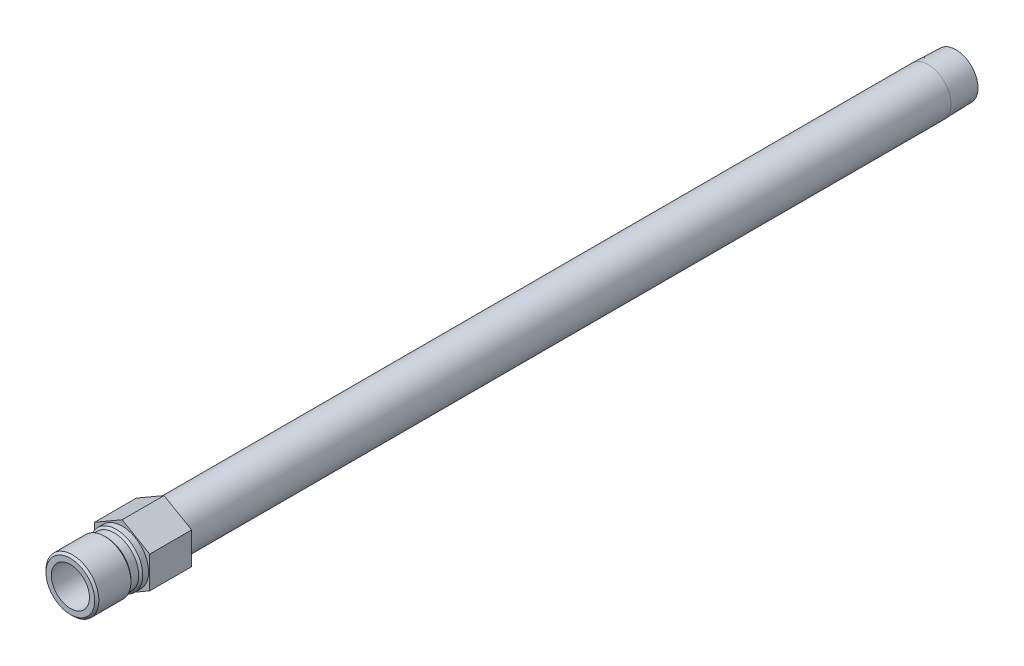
ISO-10303-21;
HEADER;
FILE_DESCRIPTION(('STEP AP214'),'2;1');
FILE_NAME('part.step','',(''),(''),'','','');
FILE_SCHEMA(('AUTOMOTIVE_DESIGN { 1 0 10303 214 1 1 1 1 }'));
ENDSEC;
DATA;
#1=APPLICATION_CONTEXT('core data for automotive mechanical design processes');
#2=APPLICATION_PROTOCOL_DEFINITION('international standard','automotive_design',2000,#1);
#3=PRODUCT_CONTEXT('',#1,'mechanical');
#4=PRODUCT('Part','Part','',(#3));
#5=PRODUCT_RELATED_PRODUCT_CATEGORY('part','',(#4));
#6=PRODUCT_DEFINITION_FORMATION('','',#4);
#7=PRODUCT_DEFINITION_CONTEXT('part definition',#1,'design');
#8=PRODUCT_DEFINITION('design','',#6,#7);
#9=PRODUCT_DEFINITION_SHAPE('','',#8);
#10=(LENGTH_UNIT() NAMED_UNIT(*) SI_UNIT(.MILLI.,.METRE.));
#11=(NAMED_UNIT(*) PLANE_ANGLE_UNIT() SI_UNIT($,.RADIAN.));
#12=(NAMED_UNIT(*) SI_UNIT($,.STERADIAN.) SOLID_ANGLE_UNIT());
#13=UNCERTAINTY_MEASURE_WITH_UNIT(LENGTH_MEASURE(1.E-05),#10,'distance_accuracy_value','');
#14=(GEOMETRIC_REPRESENTATION_CONTEXT(3) GLOBAL_UNCERTAINTY_ASSIGNED_CONTEXT((#13)) GLOBAL_UNIT_ASSIGNED_CONTEXT((#10,
#11,#12)) REPRESENTATION_CONTEXT('',''));
#15=CARTESIAN_POINT('',(0.,0.,0.));
#16=DIRECTION('',(0.,0.,1.));
#17=DIRECTION('',(1.,0.,0.));
#18=AXIS2_PLACEMENT_3D('',#15,#16,#17);
#19=CARTESIAN_POINT('',(0.,0.,0.));
#20=DIRECTION('',(0.,0.,-1.));
#21=DIRECTION('',(0.,1.,0.));
#22=AXIS2_PLACEMENT_3D('',#19,#20,#21);
#23=CYLINDRICAL_SURFACE('',#22,8.5725);
#24=CARTESIAN_POINT('',(0.,0.,-300.5582));
#25=DIRECTION('',(0.,0.,-1.));
#26=DIRECTION('',(0.,1.,0.));
#27=AXIS2_PLACEMENT_3D('',#24,#25,#26);
#28=CIRCLE('',#27,8.57250000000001);
#29=CARTESIAN_POINT('',(0.,8.5725,-300.5582));
#30=VERTEX_POINT('',#29);
#31=EDGE_CURVE('E158',#30,#30,#28,.T.);
#32=ORIENTED_EDGE('',*,*,#31,.F.);
#33=EDGE_LOOP('',(#32));
#34=FACE_BOUND('',#33,.T.);
#35=CARTESIAN_POINT('',(0.,0.,-15.621));
#36=DIRECTION('',(0.,0.,1.));
#37=DIRECTION('',(1.,0.,0.));
#38=AXIS2_PLACEMENT_3D('',#35,#36,#37);
#39=CIRCLE('',#38,8.5725);
#40=CARTESIAN_POINT('',(8.5725,0.,-15.621));
#41=VERTEX_POINT('',#40);
#42=EDGE_CURVE('E39',#41,#41,#39,.F.);
#43=ORIENTED_EDGE('',*,*,#42,.T.);
#44=EDGE_LOOP('',(#43));
#45=FACE_BOUND('',#44,.T.);
#46=ADVANCED_FACE('F35',(#34,#45),#23,.T.);
#47=CARTESIAN_POINT('',(0.,0.,0.));
#48=DIRECTION('',(0.,0.,-1.));
#49=DIRECTION('',(0.,1.,0.));
#50=AXIS2_PLACEMENT_3D('',#47,#48,#49);
#51=CYLINDRICAL_SURFACE('',#50,7.112);
#52=CARTESIAN_POINT('',(0.,0.,1.524));
#53=DIRECTION('',(0.,0.,-1.));
#54=DIRECTION('',(0.,1.,0.));
#55=AXIS2_PLACEMENT_3D('',#52,#53,#54);
#56=CIRCLE('',#55,7.112);
#57=CARTESIAN_POINT('',(0.,7.112,1.524));
#58=VERTEX_POINT('',#57);
#59=EDGE_CURVE('E146',#58,#58,#56,.T.);
#60=ORIENTED_EDGE('',*,*,#59,.T.);
#61=EDGE_LOOP('',(#60));
#62=FACE_BOUND('',#61,.T.);
#63=CARTESIAN_POINT('',(0.,0.,19.304));
#64=DIRECTION('',(0.,0.,-1.));
#65=DIRECTION('',(0.,1.,0.));
#66=AXIS2_PLACEMENT_3D('',#63,#64,#65);
#67=CIRCLE('',#66,7.112);
#68=CARTESIAN_POINT('',(0.,7.112,19.304));
#69=VERTEX_POINT('',#68);
#70=EDGE_CURVE('E11',#69,#69,#67,.T.);
#71=ORIENTED_EDGE('',*,*,#70,.F.);
#72=EDGE_LOOP('',(#71));
#73=FACE_BOUND('',#72,.T.);
#74=ADVANCED_FACE('F37',(#62,#73),#51,.F.);
#75=CARTESIAN_POINT('',(0.,7.112,19.304));
#76=DIRECTION('',(0.,0.,1.));
#77=DIRECTION('',(0.,-1.,0.));
#78=AXIS2_PLACEMENT_3D('',#75,#76,#77);
#79=PLANE('',#78);
#80=ORIENTED_EDGE('',*,*,#70,.T.);
#81=EDGE_LOOP('',(#80));
#82=FACE_BOUND('',#81,.T.);
#83=CARTESIAN_POINT('',(0.,0.,19.304));
#84=DIRECTION('',(0.,0.,-1.));
#85=DIRECTION('',(0.,1.,0.));
#86=AXIS2_PLACEMENT_3D('',#83,#84,#85);
#87=CIRCLE('',#86,9.09319999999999);
#88=CARTESIAN_POINT('',(0.,9.0932,19.304));
#89=VERTEX_POINT('',#88);
#90=EDGE_CURVE('E45',#89,#89,#87,.T.);
#91=ORIENTED_EDGE('',*,*,#90,.F.);
#92=EDGE_LOOP('',(#91));
#93=FACE_BOUND('',#92,.T.);
#94=ADVANCED_FACE('F185',(#82,#93),#79,.T.);
#95=CARTESIAN_POINT('',(0.,0.,18.542));
#96=DIRECTION('',(0.,0.,-1.));
#97=DIRECTION('',(0.,1.,0.));
#98=AXIS2_PLACEMENT_3D('',#95,#96,#97);
#99=CONICAL_SURFACE('',#98,9.8552,0.785398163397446);
#100=ORIENTED_EDGE('',*,*,#90,.T.);
#101=EDGE_LOOP('',(#100));
#102=FACE_BOUND('',#101,.T.);
#103=CARTESIAN_POINT('',(0.,0.,18.542));
#104=DIRECTION('',(0.,0.,-1.));
#105=DIRECTION('',(0.,1.,0.));
#106=AXIS2_PLACEMENT_3D('',#103,#104,#105);
#107=CIRCLE('',#106,9.8552);
#108=CARTESIAN_POINT('',(0.,9.8552,18.542));
#109=VERTEX_POINT('',#108);
#110=EDGE_CURVE('E176',#109,#109,#107,.T.);
#111=ORIENTED_EDGE('',*,*,#110,.F.);
#112=EDGE_LOOP('',(#111));
#113=FACE_BOUND('',#112,.T.);
#114=ADVANCED_FACE('F182',(#102,#113),#99,.T.);
#115=CARTESIAN_POINT('',(0.,0.,0.));
#116=DIRECTION('',(0.,0.,-1.));
#117=DIRECTION('',(0.,1.,0.));
#118=AXIS2_PLACEMENT_3D('',#115,#116,#117);
#119=CYLINDRICAL_SURFACE('',#118,9.8552);
#120=ORIENTED_EDGE('',*,*,#110,.T.);
#121=EDGE_LOOP('',(#120));
#122=FACE_BOUND('',#121,.T.);
#123=CARTESIAN_POINT('',(0.,0.,6.5786));
#124=DIRECTION('',(0.,0.,-1.));
#125=DIRECTION('',(0.,1.,0.));
#126=AXIS2_PLACEMENT_3D('',#123,#124,#125);
#127=CIRCLE('',#126,9.8552);
#128=CARTESIAN_POINT('',(0.,9.8552,6.5786));
#129=VERTEX_POINT('',#128);
#130=EDGE_CURVE('E173',#129,#129,#127,.T.);
#131=ORIENTED_EDGE('',*,*,#130,.F.);
#132=EDGE_LOOP('',(#131));
#133=FACE_BOUND('',#132,.T.);
#134=ADVANCED_FACE('F192',(#122,#133),#119,.T.);
#135=CARTESIAN_POINT('',(0.,0.,5.8166));
#136=DIRECTION('',(0.,0.,1.));
#137=DIRECTION('',(0.,-1.,0.));
#138=AXIS2_PLACEMENT_3D('',#135,#136,#137);
#139=CONICAL_SURFACE('',#138,9.0932,0.785398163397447);
#140=ORIENTED_EDGE('',*,*,#130,.T.);
#141=EDGE_LOOP('',(#140));
#142=FACE_BOUND('',#141,.T.);
#143=CARTESIAN_POINT('',(0.,0.,5.8166));
#144=DIRECTION('',(0.,0.,-1.));
#145=DIRECTION('',(0.,1.,0.));
#146=AXIS2_PLACEMENT_3D('',#143,#144,#145);
#147=CIRCLE('',#146,9.0932);
#148=CARTESIAN_POINT('',(0.,9.0932,5.8166));
#149=VERTEX_POINT('',#148);
#150=EDGE_CURVE('E170',#149,#149,#147,.T.);
#151=ORIENTED_EDGE('',*,*,#150,.F.);
#152=EDGE_LOOP('',(#151));
#153=FACE_BOUND('',#152,.T.);
#154=ADVANCED_FACE('F217',(#142,#153),#139,.T.);
#155=CARTESIAN_POINT('',(0.,0.,0.));
#156=DIRECTION('',(0.,0.,-1.));
#157=DIRECTION('',(0.,1.,0.));
#158=AXIS2_PLACEMENT_3D('',#155,#156,#157);
#159=CYLINDRICAL_SURFACE('',#158,9.0932);
#160=ORIENTED_EDGE('',*,*,#150,.T.);
#161=EDGE_LOOP('',(#160));
#162=FACE_BOUND('',#161,.T.);
#163=CARTESIAN_POINT('',(0.,0.,2.921));
#164=DIRECTION('',(0.,0.,-1.));
#165=DIRECTION('',(0.,1.,0.));
#166=AXIS2_PLACEMENT_3D('',#163,#164,#165);
#167=CIRCLE('',#166,9.0932);
#168=CARTESIAN_POINT('',(0.,9.0932,2.921));
#169=VERTEX_POINT('',#168);
#170=EDGE_CURVE('E167',#169,#169,#167,.T.);
#171=ORIENTED_EDGE('',*,*,#170,.F.);
#172=EDGE_LOOP('',(#171));
#173=FACE_BOUND('',#172,.T.);
#174=ADVANCED_FACE('F213',(#162,#173),#159,.T.);
#175=CARTESIAN_POINT('',(0.,0.,2.159));
#176=DIRECTION('',(0.,0.,-1.));
#177=DIRECTION('',(0.,1.,0.));
#178=AXIS2_PLACEMENT_3D('',#175,#176,#177);
#179=CONICAL_SURFACE('',#178,9.8552,0.785398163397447);
#180=ORIENTED_EDGE('',*,*,#170,.T.);
#181=EDGE_LOOP('',(#180));
#182=FACE_BOUND('',#181,.T.);
#183=CARTESIAN_POINT('',(0.,0.,2.159));
#184=DIRECTION('',(0.,0.,-1.));
#185=DIRECTION('',(0.,1.,0.));
#186=AXIS2_PLACEMENT_3D('',#183,#184,#185);
#187=CIRCLE('',#186,9.8552);
#188=CARTESIAN_POINT('',(0.,9.8552,2.159));
#189=VERTEX_POINT('',#188);
#190=EDGE_CURVE('E164',#189,#189,#187,.T.);
#191=ORIENTED_EDGE('',*,*,#190,.F.);
#192=EDGE_LOOP('',(#191));
#193=FACE_BOUND('',#192,.T.);
#194=ADVANCED_FACE('F209',(#182,#193),#179,.T.);
#195=CARTESIAN_POINT('',(0.,0.,0.));
#196=DIRECTION('',(0.,0.,-1.));
#197=DIRECTION('',(0.,1.,0.));
#198=AXIS2_PLACEMENT_3D('',#195,#196,#197);
#199=CYLINDRICAL_SURFACE('',#198,9.8552);
#200=ORIENTED_EDGE('',*,*,#190,.T.);
#201=EDGE_LOOP('',(#200));
#202=FACE_BOUND('',#201,.T.);
#203=CARTESIAN_POINT('',(0.,0.,0.));
#204=DIRECTION('',(0.,0.,-1.));
#205=DIRECTION('',(0.,1.,0.));
#206=AXIS2_PLACEMENT_3D('',#203,#204,#205);
#207=CIRCLE('',#206,9.8552);
#208=CARTESIAN_POINT('',(0.,9.8552,0.));
#209=VERTEX_POINT('',#208);
#210=EDGE_CURVE('E161',#209,#209,#207,.T.);
#211=ORIENTED_EDGE('',*,*,#210,.F.);
#212=EDGE_LOOP('',(#211));
#213=FACE_BOUND('',#212,.T.);
#214=ADVANCED_FACE('F206',(#202,#213),#199,.T.);
#215=CARTESIAN_POINT('',(0.,0.,-310.896));
#216=DIRECTION('',(0.,0.,1.));
#217=DIRECTION('',(0.,-1.,0.));
#218=AXIS2_PLACEMENT_3D('',#215,#216,#217);
#219=CONICAL_SURFACE('',#218,8.24944566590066,0.0312396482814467);
#220=ORIENTED_EDGE('',*,*,#31,.T.);
#221=EDGE_LOOP('',(#220));
#222=FACE_BOUND('',#221,.T.);
#223=CARTESIAN_POINT('',(0.,0.,-310.896));
#224=DIRECTION('',(0.,0.,-1.));
#225=DIRECTION('',(0.,1.,0.));
#226=AXIS2_PLACEMENT_3D('',#223,#224,#225);
#227=CIRCLE('',#226,8.24944566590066);
#228=CARTESIAN_POINT('',(0.,8.24944566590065,-310.896));
#229=VERTEX_POINT('',#228);
#230=EDGE_CURVE('E155',#229,#229,#227,.T.);
#231=ORIENTED_EDGE('',*,*,#230,.F.);
#232=EDGE_LOOP('',(#231));
#233=FACE_BOUND('',#232,.T.);
#234=ADVANCED_FACE('F204',(#222,#233),#219,.T.);
#235=CARTESIAN_POINT('',(0.,8.24944566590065,-310.896));
#236=DIRECTION('',(0.,0.,-1.));
#237=DIRECTION('',(0.,1.,0.));
#238=AXIS2_PLACEMENT_3D('',#235,#236,#237);
#239=PLANE('',#238);
#240=ORIENTED_EDGE('',*,*,#230,.T.);
#241=EDGE_LOOP('',(#240));
#242=FACE_BOUND('',#241,.T.);
#243=CARTESIAN_POINT('',(0.,0.,-310.896));
#244=DIRECTION('',(0.,0.,-1.));
#245=DIRECTION('',(0.,1.,0.));
#246=AXIS2_PLACEMENT_3D('',#243,#244,#245);
#247=CIRCLE('',#246,6.26110000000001);
#248=CARTESIAN_POINT('',(0.,6.2611,-310.896));
#249=VERTEX_POINT('',#248);
#250=EDGE_CURVE('E152',#249,#249,#247,.T.);
#251=ORIENTED_EDGE('',*,*,#250,.F.);
#252=EDGE_LOOP('',(#251));
#253=FACE_BOUND('',#252,.T.);
#254=ADVANCED_FACE('F270',(#242,#253),#239,.T.);
#255=CARTESIAN_POINT('',(0.,0.,0.));
#256=DIRECTION('',(0.,0.,-1.));
#257=DIRECTION('',(0.,1.,0.));
#258=AXIS2_PLACEMENT_3D('',#255,#256,#257);
#259=CYLINDRICAL_SURFACE('',#258,6.2611);
#260=ORIENTED_EDGE('',*,*,#250,.T.);
#261=EDGE_LOOP('',(#260));
#262=FACE_BOUND('',#261,.T.);
#263=CARTESIAN_POINT('',(0.,0.,1.07156844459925));
#264=DIRECTION('',(0.,0.,-1.));
#265=DIRECTION('',(0.,1.,0.));
#266=AXIS2_PLACEMENT_3D('',#263,#264,#265);
#267=CIRCLE('',#266,6.2611);
#268=CARTESIAN_POINT('',(0.,6.2611,1.07156844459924));
#269=VERTEX_POINT('',#268);
#270=EDGE_CURVE('E149',#269,#269,#267,.T.);
#271=ORIENTED_EDGE('',*,*,#270,.F.);
#272=EDGE_LOOP('',(#271));
#273=FACE_BOUND('',#272,.T.);
#274=ADVANCED_FACE('F267',(#262,#273),#259,.F.);
#275=CARTESIAN_POINT('',(0.,0.,1.524));
#276=DIRECTION('',(0.,0.,1.));
#277=DIRECTION('',(0.,-1.,0.));
#278=AXIS2_PLACEMENT_3D('',#275,#276,#277);
#279=CONICAL_SURFACE('',#278,7.112,1.08210413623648);
#280=ORIENTED_EDGE('',*,*,#270,.T.);
#281=EDGE_LOOP('',(#280));
#282=FACE_BOUND('',#281,.T.);
#283=ORIENTED_EDGE('',*,*,#59,.F.);
#284=EDGE_LOOP('',(#283));
#285=FACE_BOUND('',#284,.T.);
#286=ADVANCED_FACE('F255',(#282,#285),#279,.F.);
#287=CARTESIAN_POINT('',(0.,11.8784044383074,-15.621));
#288=DIRECTION('',(-0.5,0.866025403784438,0.));
#289=DIRECTION('',(-0.866025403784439,-0.5,0.));
#290=AXIS2_PLACEMENT_3D('',#287,#288,#289);
#291=PLANE('',#290);
#292=DIRECTION('',(-0.866025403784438,-0.5,0.));
#293=VECTOR('',#292,1.);
#294=CARTESIAN_POINT('',(0.,11.8784044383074,0.));
#295=LINE('',#294,#293);
#296=CARTESIAN_POINT('',(0.,11.8784044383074,0.));
#297=VERTEX_POINT('',#296);
#298=CARTESIAN_POINT('',(-10.287,5.93920221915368,0.));
#299=VERTEX_POINT('',#298);
#300=EDGE_CURVE('E124',#297,#299,#295,.T.);
#301=ORIENTED_EDGE('',*,*,#300,.F.);
#302=DIRECTION('',(0.,0.,1.));
#303=VECTOR('',#302,1.);
#304=CARTESIAN_POINT('',(0.,11.8784044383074,-15.621));
#305=LINE('',#304,#303);
#306=CARTESIAN_POINT('',(0.,11.8784044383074,-15.621));
#307=VERTEX_POINT('',#306);
#308=EDGE_CURVE('E53',#307,#297,#305,.T.);
#309=ORIENTED_EDGE('',*,*,#308,.F.);
#310=DIRECTION('',(-0.866025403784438,-0.5,0.));
#311=VECTOR('',#310,1.);
#312=CARTESIAN_POINT('',(0.,11.8784044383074,-15.621));
#313=LINE('',#312,#311);
#314=CARTESIAN_POINT('',(-10.287,5.93920221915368,-15.621));
#315=VERTEX_POINT('',#314);
#316=EDGE_CURVE('E139',#307,#315,#313,.T.);
#317=ORIENTED_EDGE('',*,*,#316,.T.);
#318=DIRECTION('',(0.,0.,1.));
#319=VECTOR('',#318,1.);
#320=CARTESIAN_POINT('',(-10.287,5.93920221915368,-15.621));
#321=LINE('',#320,#319);
#322=EDGE_CURVE('E88',#315,#299,#321,.T.);
#323=ORIENTED_EDGE('',*,*,#322,.T.);
#324=EDGE_LOOP('',(#301,#309,#317,#323));
#325=FACE_BOUND('',#324,.T.);
#326=ADVANCED_FACE('F242',(#325),#291,.T.);
#327=CARTESIAN_POINT('',(10.287,5.93920221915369,-15.621));
#328=DIRECTION('',(0.5,0.866025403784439,0.));
#329=DIRECTION('',(-0.866025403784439,0.5,0.));
#330=AXIS2_PLACEMENT_3D('',#327,#328,#329);
#331=PLANE('',#330);
#332=DIRECTION('',(-0.866025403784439,0.5,0.));
#333=VECTOR('',#332,1.);
#334=CARTESIAN_POINT('',(10.287,5.93920221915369,0.));
#335=LINE('',#334,#333);
#336=CARTESIAN_POINT('',(10.287,5.93920221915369,0.));
#337=VERTEX_POINT('',#336);
#338=EDGE_CURVE('E136',#337,#297,#335,.T.);
#339=ORIENTED_EDGE('',*,*,#338,.F.);
#340=DIRECTION('',(0.,0.,1.));
#341=VECTOR('',#340,1.);
#342=CARTESIAN_POINT('',(10.287,5.93920221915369,-15.621));
#343=LINE('',#342,#341);
#344=CARTESIAN_POINT('',(10.287,5.93920221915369,-15.621));
#345=VERTEX_POINT('',#344);
#346=EDGE_CURVE('E76',#345,#337,#343,.T.);
#347=ORIENTED_EDGE('',*,*,#346,.F.);
#348=DIRECTION('',(-0.866025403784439,0.5,0.));
#349=VECTOR('',#348,1.);
#350=CARTESIAN_POINT('',(10.287,5.93920221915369,-15.621));
#351=LINE('',#350,#349);
#352=EDGE_CURVE('E114',#345,#307,#351,.T.);
#353=ORIENTED_EDGE('',*,*,#352,.T.);
#354=ORIENTED_EDGE('',*,*,#308,.T.);
#355=EDGE_LOOP('',(#339,#347,#353,#354));
#356=FACE_BOUND('',#355,.T.);
#357=ADVANCED_FACE('F247',(#356),#331,.T.);
#358=CARTESIAN_POINT('',(10.287,-5.93920221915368,-15.621));
#359=DIRECTION('',(1.,0.,0.));
#360=DIRECTION('',(0.,0.,-1.));
#361=AXIS2_PLACEMENT_3D('',#358,#359,#360);
#362=PLANE('',#361);
#363=DIRECTION('',(0.,1.,0.));
#364=VECTOR('',#363,1.);
#365=CARTESIAN_POINT('',(10.287,-5.93920221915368,0.));
#366=LINE('',#365,#364);
#367=CARTESIAN_POINT('',(10.287,-5.93920221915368,0.));
#368=VERTEX_POINT('',#367);
#369=EDGE_CURVE('E101',#368,#337,#366,.T.);
#370=ORIENTED_EDGE('',*,*,#369,.F.);
#371=DIRECTION('',(0.,0.,1.));
#372=VECTOR('',#371,1.);
#373=CARTESIAN_POINT('',(10.287,-5.93920221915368,-15.621));
#374=LINE('',#373,#372);
#375=CARTESIAN_POINT('',(10.287,-5.93920221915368,-15.621));
#376=VERTEX_POINT('',#375);
#377=EDGE_CURVE('E96',#376,#368,#374,.T.);
#378=ORIENTED_EDGE('',*,*,#377,.F.);
#379=DIRECTION('',(0.,1.,0.));
#380=VECTOR('',#379,1.);
#381=CARTESIAN_POINT('',(10.287,-5.93920221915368,-15.621));
#382=LINE('',#381,#380);
#383=EDGE_CURVE('E99',#376,#345,#382,.T.);
#384=ORIENTED_EDGE('',*,*,#383,.T.);
#385=ORIENTED_EDGE('',*,*,#346,.T.);
#386=EDGE_LOOP('',(#370,#378,#384,#385));
#387=FACE_BOUND('',#386,.T.);
#388=ADVANCED_FACE('F98',(#387),#362,.T.);
#389=CARTESIAN_POINT('',(0.,-11.8784044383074,-15.621));
#390=DIRECTION('',(0.5,-0.866025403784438,0.));
#391=DIRECTION('',(0.866025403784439,0.5,0.));
#392=AXIS2_PLACEMENT_3D('',#389,#390,#391);
#393=PLANE('',#392);
#394=DIRECTION('',(0.866025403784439,0.5,0.));
#395=VECTOR('',#394,1.);
#396=CARTESIAN_POINT('',(0.,-11.8784044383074,0.));
#397=LINE('',#396,#395);
#398=CARTESIAN_POINT('',(0.,-11.8784044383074,0.));
#399=VERTEX_POINT('',#398);
#400=EDGE_CURVE('E133',#399,#368,#397,.T.);
#401=ORIENTED_EDGE('',*,*,#400,.F.);
#402=DIRECTION('',(0.,0.,1.));
#403=VECTOR('',#402,1.);
#404=CARTESIAN_POINT('',(0.,-11.8784044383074,-15.621));
#405=LINE('',#404,#403);
#406=CARTESIAN_POINT('',(0.,-11.8784044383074,-15.621));
#407=VERTEX_POINT('',#406);
#408=EDGE_CURVE('E106',#407,#399,#405,.T.);
#409=ORIENTED_EDGE('',*,*,#408,.F.);
#410=DIRECTION('',(0.866025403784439,0.5,0.));
#411=VECTOR('',#410,1.);
#412=CARTESIAN_POINT('',(0.,-11.8784044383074,-15.621));
#413=LINE('',#412,#411);
#414=EDGE_CURVE('E112',#407,#376,#413,.T.);
#415=ORIENTED_EDGE('',*,*,#414,.T.);
#416=ORIENTED_EDGE('',*,*,#377,.T.);
#417=EDGE_LOOP('',(#401,#409,#415,#416));
#418=FACE_BOUND('',#417,.T.);
#419=ADVANCED_FACE('F116',(#418),#393,.T.);
#420=CARTESIAN_POINT('',(-10.287,-5.93920221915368,-15.621));
#421=DIRECTION('',(-0.5,-0.866025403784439,0.));
#422=DIRECTION('',(0.866025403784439,-0.5,0.));
#423=AXIS2_PLACEMENT_3D('',#420,#421,#422);
#424=PLANE('',#423);
#425=DIRECTION('',(0.866025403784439,-0.5,0.));
#426=VECTOR('',#425,1.);
#427=CARTESIAN_POINT('',(-10.287,-5.93920221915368,0.));
#428=LINE('',#427,#426);
#429=CARTESIAN_POINT('',(-10.287,-5.93920221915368,0.));
#430=VERTEX_POINT('',#429);
#431=EDGE_CURVE('E130',#430,#399,#428,.T.);
#432=ORIENTED_EDGE('',*,*,#431,.F.);
#433=DIRECTION('',(0.,0.,1.));
#434=VECTOR('',#433,1.);
#435=CARTESIAN_POINT('',(-10.287,-5.93920221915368,-15.621));
#436=LINE('',#435,#434);
#437=CARTESIAN_POINT('',(-10.287,-5.93920221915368,-15.621));
#438=VERTEX_POINT('',#437);
#439=EDGE_CURVE('E143',#438,#430,#436,.T.);
#440=ORIENTED_EDGE('',*,*,#439,.F.);
#441=DIRECTION('',(0.866025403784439,-0.5,0.));
#442=VECTOR('',#441,1.);
#443=CARTESIAN_POINT('',(-10.287,-5.93920221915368,-15.621));
#444=LINE('',#443,#442);
#445=EDGE_CURVE('E117',#438,#407,#444,.T.);
#446=ORIENTED_EDGE('',*,*,#445,.T.);
#447=ORIENTED_EDGE('',*,*,#408,.T.);
#448=EDGE_LOOP('',(#432,#440,#446,#447));
#449=FACE_BOUND('',#448,.T.);
#450=ADVANCED_FACE('F246',(#449),#424,.T.);
#451=CARTESIAN_POINT('',(-10.287,5.93920221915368,-15.621));
#452=DIRECTION('',(-1.,0.,0.));
#453=DIRECTION('',(0.,0.,1.));
#454=AXIS2_PLACEMENT_3D('',#451,#452,#453);
#455=PLANE('',#454);
#456=DIRECTION('',(0.,-1.,0.));
#457=VECTOR('',#456,1.);
#458=CARTESIAN_POINT('',(-10.287,5.93920221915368,0.));
#459=LINE('',#458,#457);
#460=EDGE_CURVE('E127',#299,#430,#459,.T.);
#461=ORIENTED_EDGE('',*,*,#460,.F.);
#462=ORIENTED_EDGE('',*,*,#322,.F.);
#463=DIRECTION('',(0.,-1.,0.));
#464=VECTOR('',#463,1.);
#465=CARTESIAN_POINT('',(-10.287,5.93920221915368,-15.621));
#466=LINE('',#465,#464);
#467=EDGE_CURVE('E119',#315,#438,#466,.T.);
#468=ORIENTED_EDGE('',*,*,#467,.T.);
#469=ORIENTED_EDGE('',*,*,#439,.T.);
#470=EDGE_LOOP('',(#461,#462,#468,#469));
#471=FACE_BOUND('',#470,.T.);
#472=ADVANCED_FACE('F243',(#471),#455,.T.);
#473=CARTESIAN_POINT('',(-10.287,5.93920221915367,-15.621));
#474=DIRECTION('',(0.,0.,1.));
#475=DIRECTION('',(1.,0.,0.));
#476=AXIS2_PLACEMENT_3D('',#473,#474,#475);
#477=PLANE('',#476);
#478=ORIENTED_EDGE('',*,*,#42,.F.);
#479=EDGE_LOOP('',(#478));
#480=FACE_BOUND('',#479,.T.);
#481=ORIENTED_EDGE('',*,*,#316,.F.);
#482=ORIENTED_EDGE('',*,*,#352,.F.);
#483=ORIENTED_EDGE('',*,*,#383,.F.);
#484=ORIENTED_EDGE('',*,*,#414,.F.);
#485=ORIENTED_EDGE('',*,*,#445,.F.);
#486=ORIENTED_EDGE('',*,*,#467,.F.);
#487=EDGE_LOOP('',(#481,#482,#483,#484,#485,#486));
#488=FACE_BOUND('',#487,.T.);
#489=ADVANCED_FACE('F110',(#480,#488),#477,.F.);
#490=CARTESIAN_POINT('',(-10.287,5.93920221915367,0.));
#491=DIRECTION('',(0.,0.,1.));
#492=DIRECTION('',(1.,0.,0.));
#493=AXIS2_PLACEMENT_3D('',#490,#491,#492);
#494=PLANE('',#493);
#495=ORIENTED_EDGE('',*,*,#210,.T.);
#496=EDGE_LOOP('',(#495));
#497=FACE_BOUND('',#496,.T.);
#498=ORIENTED_EDGE('',*,*,#300,.T.);
#499=ORIENTED_EDGE('',*,*,#460,.T.);
#500=ORIENTED_EDGE('',*,*,#431,.T.);
#501=ORIENTED_EDGE('',*,*,#400,.T.);
#502=ORIENTED_EDGE('',*,*,#369,.T.);
#503=ORIENTED_EDGE('',*,*,#338,.T.);
#504=EDGE_LOOP('',(#498,#499,#500,#501,#502,#503));
#505=FACE_BOUND('',#504,.T.);
#506=ADVANCED_FACE('F238',(#497,#505),#494,.T.);
#507=CLOSED_SHELL('',(#46,#74,#94,#114,#134,#154,#174,#194,#214,#234,#254,#274,#286,#326,#357,
#388,#419,#450,#472,#489,#506));
#508=MANIFOLD_SOLID_BREP('B2',#507);
#509=ADVANCED_BREP_SHAPE_REPRESENTATION('',(#18,#508),#14);
#510=SHAPE_DEFINITION_REPRESENTATION(#9,#509);
ENDSEC;
END-ISO-10303-21;
